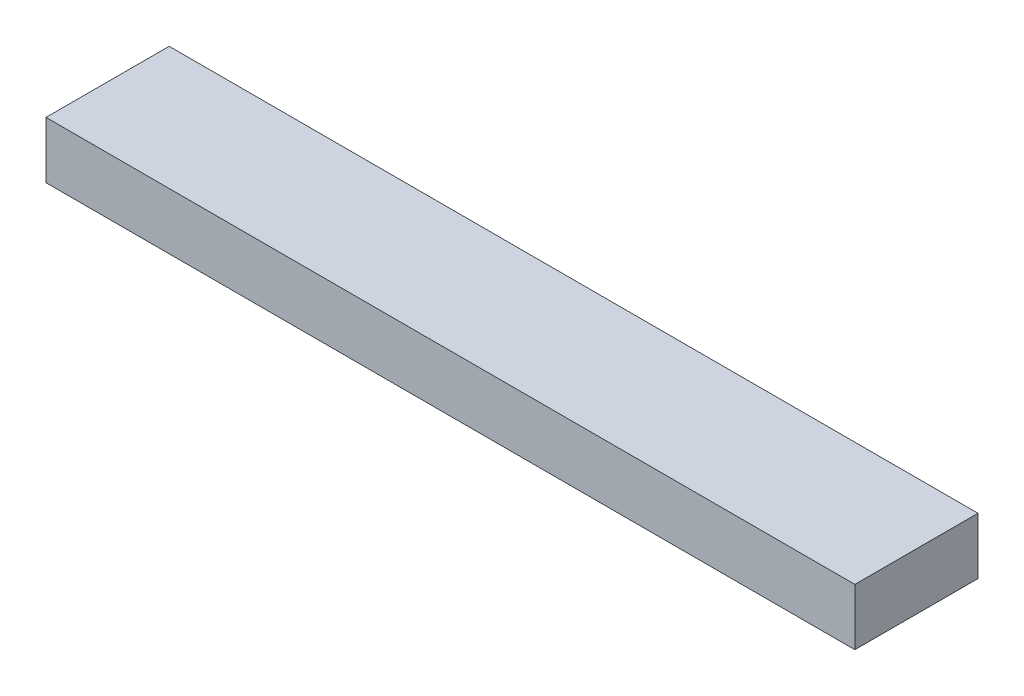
from build123d import *

# Parameters (mm, degrees)
ESQUISSE1_W        = 243
ESQUISSE1_H        = 17
BOSS_EXTRU_1_DEPTH = 37


with BuildPart() as part:
    # Esquisse1 → Boss.-Extru.1 (new body)
    with BuildSketch(Plane.XY):
        Rectangle(ESQUISSE1_W, ESQUISSE1_H)
    extrude(amount=BOSS_EXTRU_1_DEPTH)


solid = part.part
